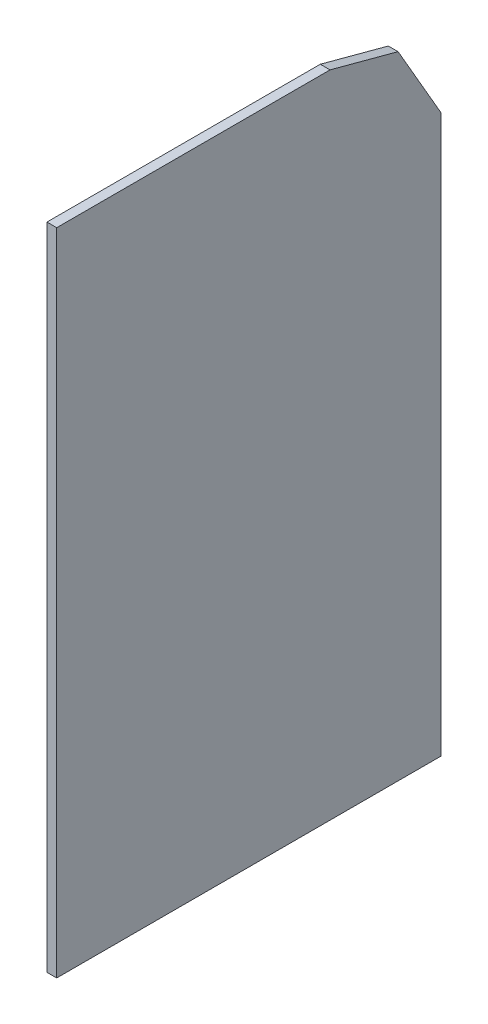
from build123d import *

# Parameters (mm, degrees)
SKETCH1_W               = 76.2
SKETCH1_H               = 3000
BOSS_EXTRUDE1_DEPTH     = 5101.6125
CHAMFER1_SIZE           = 30
CUT_EXTRUDE1_DEPTH      = 5318.697030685
CUT_EXTRUDE1_DEPTH_BACK = 5318.697030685


with BuildPart() as part:
    # Sketch1 → Boss-Extrude1 (new body)
    with BuildSketch(Plane(origin=(0, 0, 0), x_dir=(-1, 0, 0), z_dir=(0, 1, 0))):
        Rectangle(SKETCH1_W, SKETCH1_H)
    extrude(amount=BOSS_EXTRUDE1_DEPTH)

    # Chamfer1
    chamfer1_edges = [part.edges().sort_by_distance(p)[0] for p in [
        (0, 0, -1500),
        (38.1, 0, 0),
        (0, 0, 1500),
        (-38.1, 0, 0),
    ]]
    chamfer(chamfer1_edges, length=CHAMFER1_SIZE)

    # Sketch5 → Cut-Extrude1 (cut, two sides: drawn at the far end of the back side and taken through both)
    with BuildSketch(Plane.YZ.offset(-CUT_EXTRUDE1_DEPTH_BACK)):
        Polygon((5101.6125, -633.394994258), (5101.6125, -1500), (4380.429711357, -1500), (4380.429711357, -1498.700961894), (4959.30710999, -1164.485939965), align=None)
    extrude(amount=CUT_EXTRUDE1_DEPTH + CUT_EXTRUDE1_DEPTH_BACK, mode=Mode.SUBTRACT)


solid = part.part
